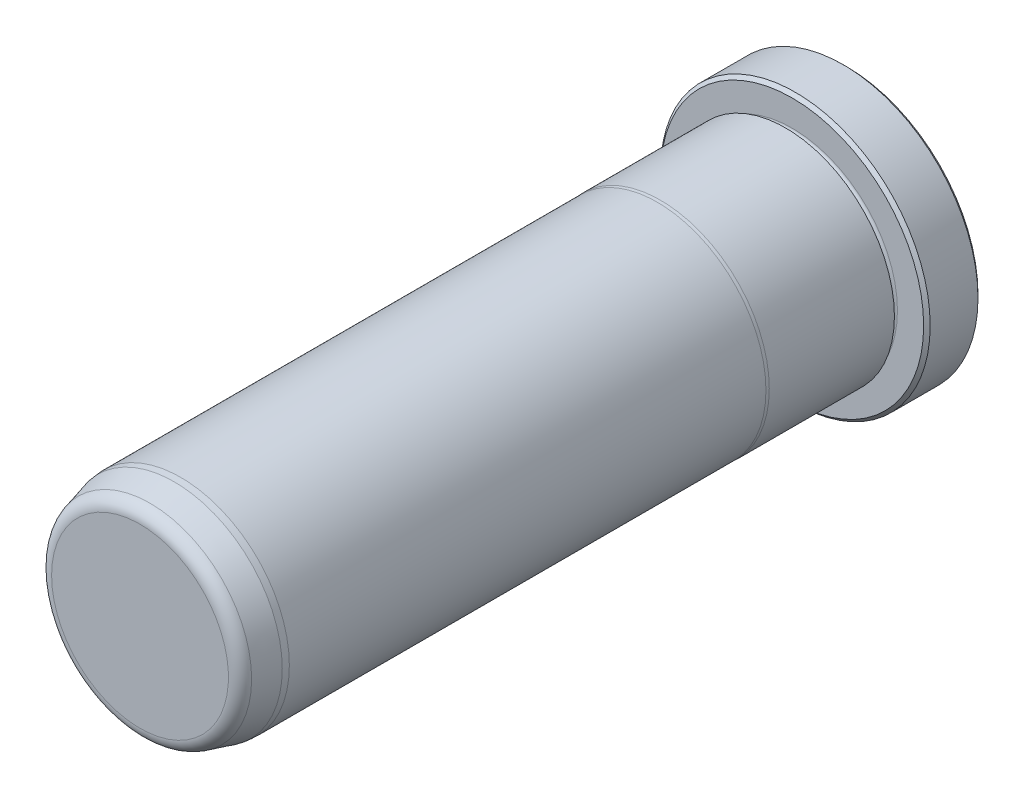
from build123d import *

# Parameters (mm, degrees)
FILLET6_R     = 1.5875
CHAMFER1_SIZE = 0.381


with BuildPart() as part:
    # Sketch1 → Revolve1 (revolve)
    with BuildSketch(Plane(origin=(0, 0, 0), x_dir=(0, 0, -1), z_dir=(1, 0, 0)), mode=Mode.PRIVATE) as revolve1_sk:
        with BuildLine():
            Line((0, 0), (0, 15.748))
            Line((0, 15.748), (-6.35, 15.748))
            Line((-6.35, 15.748), (-6.35, 12.3063))
            ThreePointArc((-6.35, 12.3063), (-6.731, 11.9253), (-7.112, 12.3063))
            Line((-7.112, 12.3063), (-7.112, 12.7127))
            Line((-7.112, 12.7127), (-21.734763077, 12.7127))
            Line((-21.734763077, 12.7127), (-22.098, 12.6873))
            Line((-22.098, 12.6873), (-77.7875, 12.6873))
            Line((-77.7875, 12.6873), (-78.5495, 12.620633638))
            Line((-78.5495, 12.620633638), (-82.55, 11.548702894))
            Line((-82.55, 11.548702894), (-82.55, 0))
            Line((-82.55, 0), (0, 0))
        make_face()
    revolve(revolve1_sk.sketch.rotate(Axis((0, 0, 0), (0, 0, -1)), 90), axis=Axis((0, 0, 0), (0, 0, -1)))

    # Fillet6
    fillet6_edges = [part.edges().sort_by_distance(p)[0] for p in [
        (-11.548702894, 0, 82.55),
    ]]
    fillet(fillet6_edges, radius=FILLET6_R)

    # Chamfer1
    chamfer1_edges = [part.edges().sort_by_distance(p)[0] for p in [
        (-15.748, 0, 6.35),
        (-15.748, 0, 0),
    ]]
    chamfer(chamfer1_edges, length=CHAMFER1_SIZE)


solid = part.part
